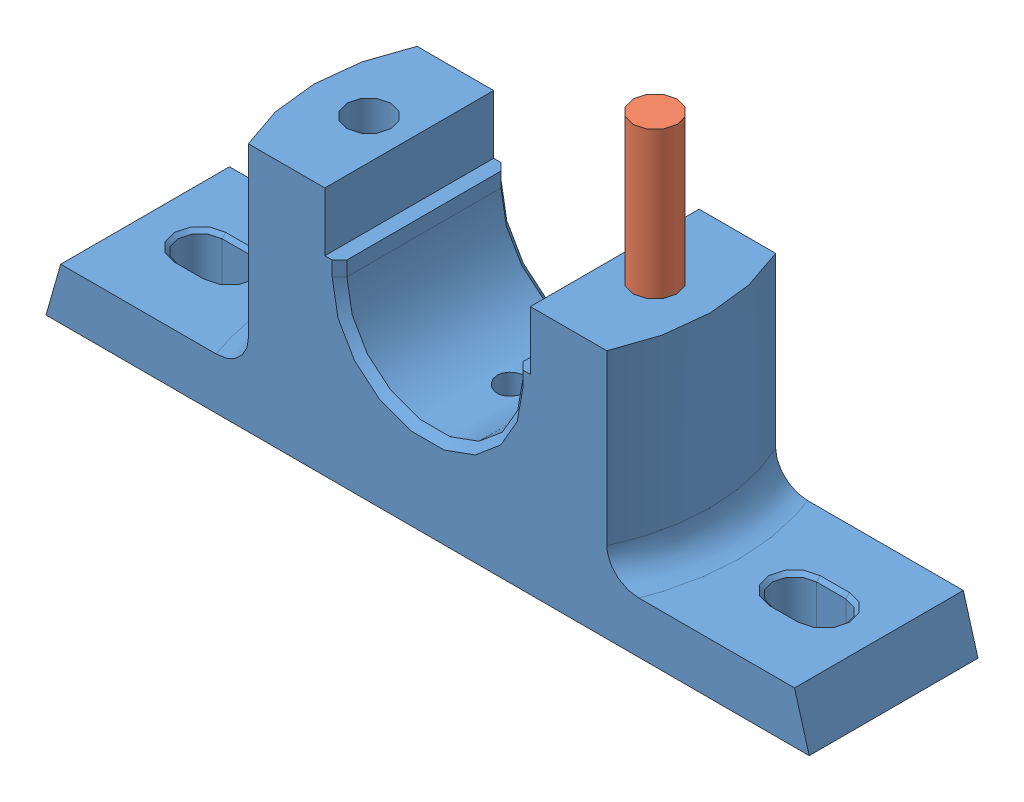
SolidWorks assembly Feature-based Mates.SLDASM, configuration Default (file format 8000). Lengths in mm.
Overall size (208 108 46).
2 component instances, 2 part files, 2 mates.
Components (placement in the parent):
- casting-1: casting.SLDPRT [Default] at (71.1092 66.3432 168.6772) size (208 68 46)
- bolt-1: bolt.SLDPRT [Default] at (110.1092 78.3432 168.6772) size (26.18 105 26.18)
Mates (geometry in assembly coordinates):
- Concentric11: concentric: cylinder of casting-1 through (110.1092 134.3432 168.6772) axis (0 -1 0) radius 6; cylinder of bolt-1 through (186.3015 22.4178 233.7586) axis (0 -1 0) radius 6
- Coincident11: coincident: plane of casting-1 through (97.1092 78.3432 155.6772) normal (0 -1 0); plane of bolt-1 through (174.3015 -73.5822 245.7586) normal (0 1 0)
